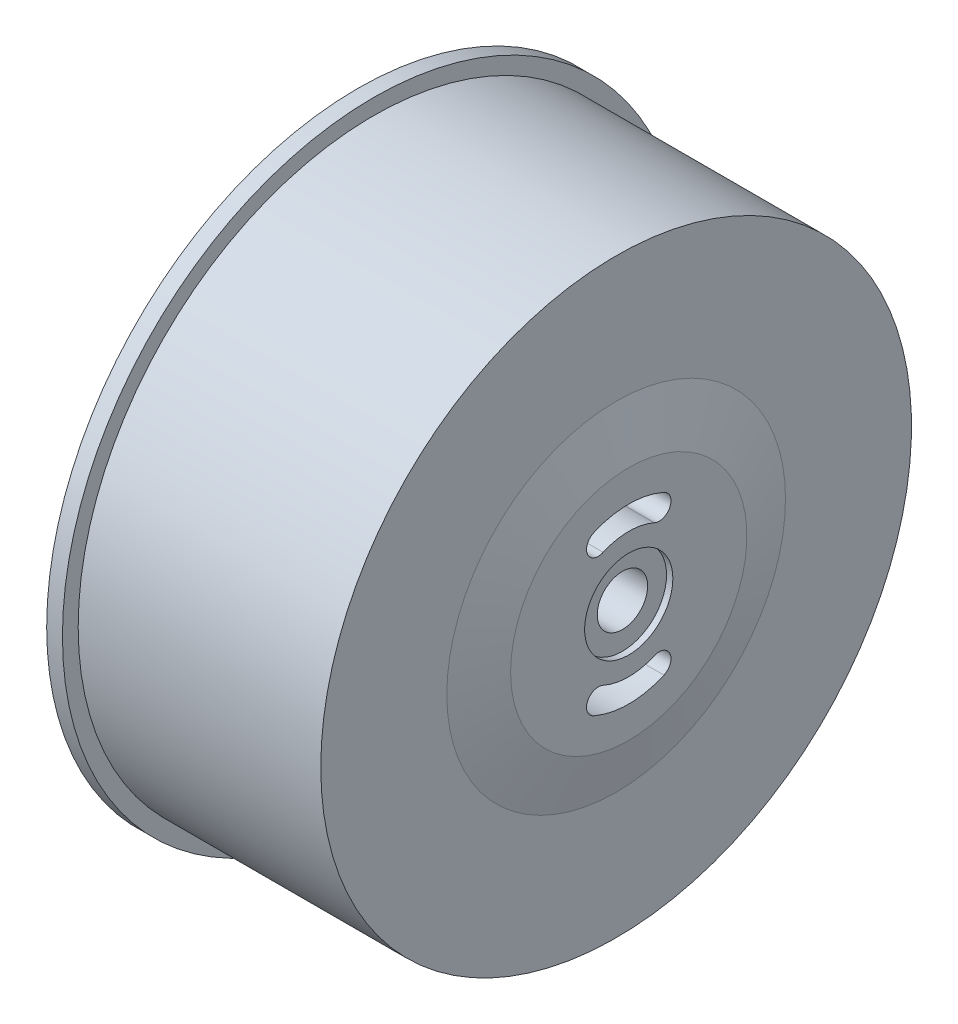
from build123d import *
from build123d.topology import SkipClean

# Parameters (mm, degrees)
ENL_V_MAT_EXTRU_1_DEPTH      = 33.801905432
R_P_TITION_CIRCULAIRE1_COUNT = 2
ESQUISSE3_R                  = 4
EXTRUSION1_DEPTH             = 3
ESQUISSE4_R                  = 2.5
EXTRUSION2_DEPTH             = 0.8
ESQUISSE5_R                  = 1.6
ENL_V_MAT_EXTRU_2_DEPTH      = 30.982244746
ESQUISSE6_R                  = 2.8
ENL_V_MAT_EXTRU_3_DEPTH      = 0.4


with BuildPart() as part:
    # Esquisse1 → R_volution1 (revolve)
    with BuildSketch(Plane.XY, mode=Mode.PRIVATE) as r_volution1_sk:
        Polygon((0, 16.25), (0, 19.75), (1, 19.75), (1, 18.75), (16.4, 18.75), (16.4, 10.75), (17.2, 7.5), (17.2, 0), (14.7, 0), (14.7, 16.25), align=None)
    revolve(r_volution1_sk.sketch.rotate(Axis((14.7, 0, 0), (1, 0, 0)), 90), axis=Axis((14.7, 0, 0), (1, 0, 0)))

    # Esquisse2 → Enl_v. mat.-Extru.1 (cut, through all)
    with BuildSketch(Plane(origin=(17.2, 0, 0), x_dir=(0, 0, -1), z_dir=(1, 0, 0))):
        with BuildLine():
            ThreePointArc((1.625097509, 3.655004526), (0, 4), (-1.625097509, 3.655004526))
            ThreePointArc((-1.625097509, 3.655004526), (-2.615116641, 4.035612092), (-2.234509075, 5.025631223))
            ThreePointArc((-2.234509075, 5.025631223), (0, 5.5), (2.234509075, 5.025631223))
            ThreePointArc((2.234509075, 5.025631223), (2.615116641, 4.035612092), (1.625097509, 3.655004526))
        make_face()
    enl_v_mat_extru_1 = extrude(amount=-ENL_V_MAT_EXTRU_1_DEPTH, mode=Mode.SUBTRACT)

    # R_p_tition circulaire1: Enl_v. mat.-Extru.1 ×2 about axis
    r_p_tition_circulaire1_axis = Axis((0, 0, 0), (1, 0, 0))
    for i in range(1, R_P_TITION_CIRCULAIRE1_COUNT):
        add(enl_v_mat_extru_1.rotate(r_p_tition_circulaire1_axis, i * 360 / R_P_TITION_CIRCULAIRE1_COUNT), mode=Mode.SUBTRACT)

    # Esquisse3 → Extrusion1 (add)
    with SkipClean():  # the faces are left unmerged after this step: merging them gives an invalid solid
        with BuildSketch(Plane.ZY.offset(-14.7)):
            with Locations(Location((0, 0, 0), (0, 0, 246.028989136))):
                Circle(ESQUISSE3_R)
        extrude(amount=EXTRUSION1_DEPTH)

    # Esquisse4 → Extrusion2 (add)
    with SkipClean():  # the faces are left unmerged after this step: merging them gives an invalid solid
        with BuildSketch(Plane.ZY.offset(-11.7)):
            Circle(ESQUISSE4_R)
        extrude(amount=EXTRUSION2_DEPTH)

    # Esquisse5 → Enl_v. mat.-Extru.2 (cut, through all)
    with SkipClean():  # the faces are left unmerged after this step: merging them gives an invalid solid
        with BuildSketch(Plane.ZY.offset(-10.9)):
            Circle(ESQUISSE5_R)
        extrude(amount=-ENL_V_MAT_EXTRU_2_DEPTH, mode=Mode.SUBTRACT)

    # Esquisse6 → Enl_v. mat.-Extru.3 (cut)
    with SkipClean():  # the faces are left unmerged after this step: merging them gives an invalid solid
        with BuildSketch(Plane(origin=(17.2, 0, 0), x_dir=(0, 0, -1), z_dir=(1, 0, 0))):
            Circle(ESQUISSE6_R)
        extrude(amount=-ENL_V_MAT_EXTRU_3_DEPTH, mode=Mode.SUBTRACT)


solid = part.part
